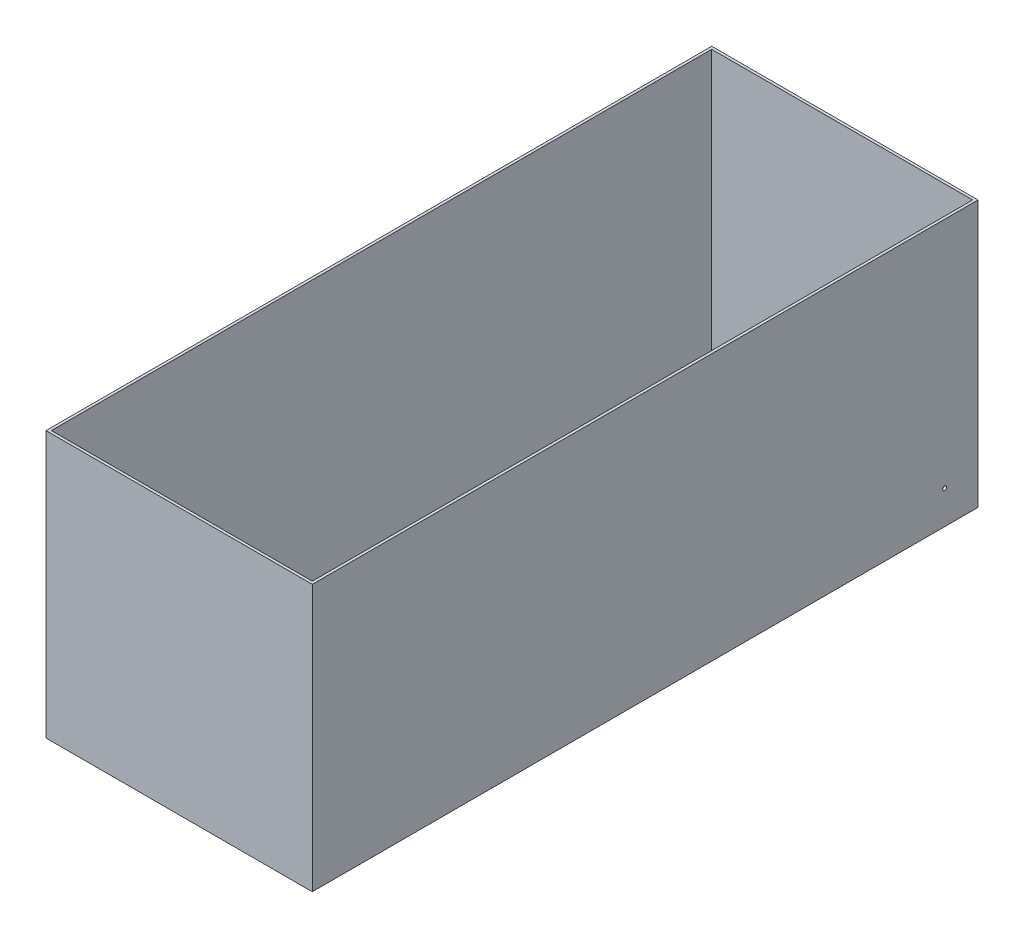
ISO-10303-21;
HEADER;
FILE_DESCRIPTION(('STEP AP214'),'2;1');
FILE_NAME('part.step','',(''),(''),'','','');
FILE_SCHEMA(('AUTOMOTIVE_DESIGN { 1 0 10303 214 1 1 1 1 }'));
ENDSEC;
DATA;
#1=APPLICATION_CONTEXT('core data for automotive mechanical design processes');
#2=APPLICATION_PROTOCOL_DEFINITION('international standard','automotive_design',2000,#1);
#3=PRODUCT_CONTEXT('',#1,'mechanical');
#4=PRODUCT('Part','Part','',(#3));
#5=PRODUCT_RELATED_PRODUCT_CATEGORY('part','',(#4));
#6=PRODUCT_DEFINITION_FORMATION('','',#4);
#7=PRODUCT_DEFINITION_CONTEXT('part definition',#1,'design');
#8=PRODUCT_DEFINITION('design','',#6,#7);
#9=PRODUCT_DEFINITION_SHAPE('','',#8);
#10=(LENGTH_UNIT() NAMED_UNIT(*) SI_UNIT(.MILLI.,.METRE.));
#11=(NAMED_UNIT(*) PLANE_ANGLE_UNIT() SI_UNIT($,.RADIAN.));
#12=(NAMED_UNIT(*) SI_UNIT($,.STERADIAN.) SOLID_ANGLE_UNIT());
#13=UNCERTAINTY_MEASURE_WITH_UNIT(LENGTH_MEASURE(1.E-05),#10,'distance_accuracy_value','');
#14=(GEOMETRIC_REPRESENTATION_CONTEXT(3) GLOBAL_UNCERTAINTY_ASSIGNED_CONTEXT((#13)) GLOBAL_UNIT_ASSIGNED_CONTEXT((#10,
#11,#12)) REPRESENTATION_CONTEXT('',''));
#15=CARTESIAN_POINT('',(0.,0.,0.));
#16=DIRECTION('',(0.,0.,1.));
#17=DIRECTION('',(1.,0.,0.));
#18=AXIS2_PLACEMENT_3D('',#15,#16,#17);
#19=CARTESIAN_POINT('',(0.,200.,0.));
#20=DIRECTION('',(0.,-1.,0.));
#21=DIRECTION('',(0.,0.,-1.));
#22=AXIS2_PLACEMENT_3D('',#19,#20,#21);
#23=PLANE('',#22);
#24=DIRECTION('',(0.,0.,-1.));
#25=VECTOR('',#24,1.);
#26=CARTESIAN_POINT('',(100.,200.,250.));
#27=LINE('',#26,#25);
#28=CARTESIAN_POINT('',(100.,200.,250.));
#29=VERTEX_POINT('',#28);
#30=CARTESIAN_POINT('',(100.,200.,-250.));
#31=VERTEX_POINT('',#30);
#32=EDGE_CURVE('E159',#29,#31,#27,.T.);
#33=ORIENTED_EDGE('',*,*,#32,.T.);
#34=DIRECTION('',(-1.,0.,0.));
#35=VECTOR('',#34,1.);
#36=CARTESIAN_POINT('',(-100.,200.,-250.));
#37=LINE('',#36,#35);
#38=CARTESIAN_POINT('',(-100.,200.,-250.));
#39=VERTEX_POINT('',#38);
#40=EDGE_CURVE('E94',#31,#39,#37,.T.);
#41=ORIENTED_EDGE('',*,*,#40,.T.);
#42=DIRECTION('',(0.,0.,1.));
#43=VECTOR('',#42,1.);
#44=CARTESIAN_POINT('',(-100.,200.,250.));
#45=LINE('',#44,#43);
#46=CARTESIAN_POINT('',(-100.,200.,250.));
#47=VERTEX_POINT('',#46);
#48=EDGE_CURVE('E164',#39,#47,#45,.T.);
#49=ORIENTED_EDGE('',*,*,#48,.T.);
#50=DIRECTION('',(1.,0.,0.));
#51=VECTOR('',#50,1.);
#52=CARTESIAN_POINT('',(-100.,200.,250.));
#53=LINE('',#52,#51);
#54=EDGE_CURVE('E66',#47,#29,#53,.T.);
#55=ORIENTED_EDGE('',*,*,#54,.T.);
#56=EDGE_LOOP('',(#33,#41,#49,#55));
#57=FACE_BOUND('',#56,.T.);
#58=DIRECTION('',(0.,0.,-1.));
#59=VECTOR('',#58,1.);
#60=CARTESIAN_POINT('',(98.,200.,0.));
#61=LINE('',#60,#59);
#62=CARTESIAN_POINT('',(98.,200.,248.));
#63=VERTEX_POINT('',#62);
#64=CARTESIAN_POINT('',(98.,200.,-248.));
#65=VERTEX_POINT('',#64);
#66=EDGE_CURVE('E143',#63,#65,#61,.T.);
#67=ORIENTED_EDGE('',*,*,#66,.F.);
#68=DIRECTION('',(1.,0.,0.));
#69=VECTOR('',#68,1.);
#70=CARTESIAN_POINT('',(0.,200.,248.));
#71=LINE('',#70,#69);
#72=CARTESIAN_POINT('',(-98.,200.,248.));
#73=VERTEX_POINT('',#72);
#74=EDGE_CURVE('E156',#73,#63,#71,.T.);
#75=ORIENTED_EDGE('',*,*,#74,.F.);
#76=DIRECTION('',(0.,0.,1.));
#77=VECTOR('',#76,1.);
#78=CARTESIAN_POINT('',(-98.,200.,0.));
#79=LINE('',#78,#77);
#80=CARTESIAN_POINT('',(-98.,200.,-248.));
#81=VERTEX_POINT('',#80);
#82=EDGE_CURVE('E153',#81,#73,#79,.T.);
#83=ORIENTED_EDGE('',*,*,#82,.F.);
#84=DIRECTION('',(-1.,0.,0.));
#85=VECTOR('',#84,1.);
#86=CARTESIAN_POINT('',(0.,200.,-248.));
#87=LINE('',#86,#85);
#88=EDGE_CURVE('E132',#65,#81,#87,.T.);
#89=ORIENTED_EDGE('',*,*,#88,.F.);
#90=EDGE_LOOP('',(#67,#75,#83,#89));
#91=FACE_BOUND('',#90,.T.);
#92=ADVANCED_FACE('F39',(#57,#91),#23,.F.);
#93=CARTESIAN_POINT('',(100.,200.,250.));
#94=DIRECTION('',(-1.,0.,0.));
#95=DIRECTION('',(0.,0.,1.));
#96=AXIS2_PLACEMENT_3D('',#93,#94,#95);
#97=PLANE('',#96);
#98=CARTESIAN_POINT('',(100.,25.,-225.));
#99=DIRECTION('',(1.,0.,0.));
#100=DIRECTION('',(0.,0.,-1.));
#101=AXIS2_PLACEMENT_3D('',#98,#99,#100);
#102=CIRCLE('',#101,1.5);
#103=CARTESIAN_POINT('',(100.,25.,-226.5));
#104=VERTEX_POINT('',#103);
#105=EDGE_CURVE('E192',#104,#104,#102,.T.);
#106=ORIENTED_EDGE('',*,*,#105,.F.);
#107=EDGE_LOOP('',(#106));
#108=FACE_BOUND('',#107,.T.);
#109=DIRECTION('',(0.,0.,-1.));
#110=VECTOR('',#109,1.);
#111=CARTESIAN_POINT('',(100.,0.,250.));
#112=LINE('',#111,#110);
#113=CARTESIAN_POINT('',(100.,0.,250.));
#114=VERTEX_POINT('',#113);
#115=CARTESIAN_POINT('',(100.,0.,-250.));
#116=VERTEX_POINT('',#115);
#117=EDGE_CURVE('E170',#114,#116,#112,.T.);
#118=ORIENTED_EDGE('',*,*,#117,.T.);
#119=DIRECTION('',(0.,-1.,0.));
#120=VECTOR('',#119,1.);
#121=CARTESIAN_POINT('',(100.,200.,-250.));
#122=LINE('',#121,#120);
#123=EDGE_CURVE('E11',#31,#116,#122,.T.);
#124=ORIENTED_EDGE('',*,*,#123,.F.);
#125=ORIENTED_EDGE('',*,*,#32,.F.);
#126=DIRECTION('',(0.,-1.,0.));
#127=VECTOR('',#126,1.);
#128=CARTESIAN_POINT('',(100.,200.,250.));
#129=LINE('',#128,#127);
#130=EDGE_CURVE('E169',#29,#114,#129,.T.);
#131=ORIENTED_EDGE('',*,*,#130,.T.);
#132=EDGE_LOOP('',(#118,#124,#125,#131));
#133=FACE_BOUND('',#132,.T.);
#134=ADVANCED_FACE('F41',(#108,#133),#97,.F.);
#135=CARTESIAN_POINT('',(-100.,200.,-250.));
#136=DIRECTION('',(0.,0.,1.));
#137=DIRECTION('',(1.,0.,0.));
#138=AXIS2_PLACEMENT_3D('',#135,#136,#137);
#139=PLANE('',#138);
#140=DIRECTION('',(-1.,0.,0.));
#141=VECTOR('',#140,1.);
#142=CARTESIAN_POINT('',(-100.,0.,-250.));
#143=LINE('',#142,#141);
#144=CARTESIAN_POINT('',(-100.,0.,-250.));
#145=VERTEX_POINT('',#144);
#146=EDGE_CURVE('E174',#116,#145,#143,.T.);
#147=ORIENTED_EDGE('',*,*,#146,.T.);
#148=DIRECTION('',(0.,-1.,0.));
#149=VECTOR('',#148,1.);
#150=CARTESIAN_POINT('',(-100.,200.,-250.));
#151=LINE('',#150,#149);
#152=EDGE_CURVE('E49',#39,#145,#151,.T.);
#153=ORIENTED_EDGE('',*,*,#152,.F.);
#154=ORIENTED_EDGE('',*,*,#40,.F.);
#155=ORIENTED_EDGE('',*,*,#123,.T.);
#156=EDGE_LOOP('',(#147,#153,#154,#155));
#157=FACE_BOUND('',#156,.T.);
#158=ADVANCED_FACE('F223',(#157),#139,.F.);
#159=CARTESIAN_POINT('',(-100.,200.,250.));
#160=DIRECTION('',(1.,0.,0.));
#161=DIRECTION('',(0.,0.,-1.));
#162=AXIS2_PLACEMENT_3D('',#159,#160,#161);
#163=PLANE('',#162);
#164=CARTESIAN_POINT('',(-100.,175.,225.));
#165=DIRECTION('',(-1.,0.,0.));
#166=DIRECTION('',(0.,0.,1.));
#167=AXIS2_PLACEMENT_3D('',#164,#165,#166);
#168=CIRCLE('',#167,1.5);
#169=CARTESIAN_POINT('',(-100.,175.,226.5));
#170=VERTEX_POINT('',#169);
#171=EDGE_CURVE('E204',#170,#170,#168,.T.);
#172=ORIENTED_EDGE('',*,*,#171,.F.);
#173=EDGE_LOOP('',(#172));
#174=FACE_BOUND('',#173,.T.);
#175=DIRECTION('',(0.,0.,1.));
#176=VECTOR('',#175,1.);
#177=CARTESIAN_POINT('',(-100.,0.,250.));
#178=LINE('',#177,#176);
#179=CARTESIAN_POINT('',(-100.,0.,250.));
#180=VERTEX_POINT('',#179);
#181=EDGE_CURVE('E177',#145,#180,#178,.T.);
#182=ORIENTED_EDGE('',*,*,#181,.T.);
#183=DIRECTION('',(0.,-1.,0.));
#184=VECTOR('',#183,1.);
#185=CARTESIAN_POINT('',(-100.,200.,250.));
#186=LINE('',#185,#184);
#187=EDGE_CURVE('E184',#47,#180,#186,.T.);
#188=ORIENTED_EDGE('',*,*,#187,.F.);
#189=ORIENTED_EDGE('',*,*,#48,.F.);
#190=ORIENTED_EDGE('',*,*,#152,.T.);
#191=EDGE_LOOP('',(#182,#188,#189,#190));
#192=FACE_BOUND('',#191,.T.);
#193=ADVANCED_FACE('F235',(#174,#192),#163,.F.);
#194=CARTESIAN_POINT('',(-100.,200.,250.));
#195=DIRECTION('',(0.,0.,-1.));
#196=DIRECTION('',(-1.,0.,0.));
#197=AXIS2_PLACEMENT_3D('',#194,#195,#196);
#198=PLANE('',#197);
#199=DIRECTION('',(1.,0.,0.));
#200=VECTOR('',#199,1.);
#201=CARTESIAN_POINT('',(-100.,0.,250.));
#202=LINE('',#201,#200);
#203=EDGE_CURVE('E87',#180,#114,#202,.T.);
#204=ORIENTED_EDGE('',*,*,#203,.T.);
#205=ORIENTED_EDGE('',*,*,#130,.F.);
#206=ORIENTED_EDGE('',*,*,#54,.F.);
#207=ORIENTED_EDGE('',*,*,#187,.T.);
#208=EDGE_LOOP('',(#204,#205,#206,#207));
#209=FACE_BOUND('',#208,.T.);
#210=ADVANCED_FACE('F231',(#209),#198,.F.);
#211=CARTESIAN_POINT('',(0.,0.,0.));
#212=DIRECTION('',(0.,-1.,0.));
#213=DIRECTION('',(0.,0.,-1.));
#214=AXIS2_PLACEMENT_3D('',#211,#212,#213);
#215=PLANE('',#214);
#216=ORIENTED_EDGE('',*,*,#117,.F.);
#217=ORIENTED_EDGE('',*,*,#203,.F.);
#218=ORIENTED_EDGE('',*,*,#181,.F.);
#219=ORIENTED_EDGE('',*,*,#146,.F.);
#220=EDGE_LOOP('',(#216,#217,#218,#219));
#221=FACE_BOUND('',#220,.T.);
#222=ADVANCED_FACE('F228',(#221),#215,.T.);
#223=CARTESIAN_POINT('',(98.,200.,250.));
#224=DIRECTION('',(-1.,0.,0.));
#225=DIRECTION('',(0.,0.,1.));
#226=AXIS2_PLACEMENT_3D('',#223,#224,#225);
#227=PLANE('',#226);
#228=CARTESIAN_POINT('',(98.,25.,-225.));
#229=DIRECTION('',(-1.,0.,0.));
#230=DIRECTION('',(0.,0.,1.));
#231=AXIS2_PLACEMENT_3D('',#228,#229,#230);
#232=CIRCLE('',#231,1.5);
#233=CARTESIAN_POINT('',(98.,25.,-223.5));
#234=VERTEX_POINT('',#233);
#235=EDGE_CURVE('E189',#234,#234,#232,.T.);
#236=ORIENTED_EDGE('',*,*,#235,.F.);
#237=EDGE_LOOP('',(#236));
#238=FACE_BOUND('',#237,.T.);
#239=DIRECTION('',(0.,0.,-1.));
#240=VECTOR('',#239,1.);
#241=CARTESIAN_POINT('',(98.,2.,0.));
#242=LINE('',#241,#240);
#243=CARTESIAN_POINT('',(98.,2.,248.));
#244=VERTEX_POINT('',#243);
#245=CARTESIAN_POINT('',(98.,2.,-248.));
#246=VERTEX_POINT('',#245);
#247=EDGE_CURVE('E122',#244,#246,#242,.T.);
#248=ORIENTED_EDGE('',*,*,#247,.F.);
#249=DIRECTION('',(0.,-1.,0.));
#250=VECTOR('',#249,1.);
#251=CARTESIAN_POINT('',(98.,200.,248.));
#252=LINE('',#251,#250);
#253=EDGE_CURVE('E147',#63,#244,#252,.T.);
#254=ORIENTED_EDGE('',*,*,#253,.F.);
#255=ORIENTED_EDGE('',*,*,#66,.T.);
#256=DIRECTION('',(0.,-1.,0.));
#257=VECTOR('',#256,1.);
#258=CARTESIAN_POINT('',(98.,200.,-248.));
#259=LINE('',#258,#257);
#260=EDGE_CURVE('E136',#65,#246,#259,.T.);
#261=ORIENTED_EDGE('',*,*,#260,.T.);
#262=EDGE_LOOP('',(#248,#254,#255,#261));
#263=FACE_BOUND('',#262,.T.);
#264=ADVANCED_FACE('F216',(#238,#263),#227,.T.);
#265=CARTESIAN_POINT('',(-100.,200.,-248.));
#266=DIRECTION('',(0.,0.,1.));
#267=DIRECTION('',(1.,0.,0.));
#268=AXIS2_PLACEMENT_3D('',#265,#266,#267);
#269=PLANE('',#268);
#270=DIRECTION('',(-1.,0.,0.));
#271=VECTOR('',#270,1.);
#272=CARTESIAN_POINT('',(0.,2.,-248.));
#273=LINE('',#272,#271);
#274=CARTESIAN_POINT('',(-98.,2.,-248.));
#275=VERTEX_POINT('',#274);
#276=EDGE_CURVE('E116',#246,#275,#273,.T.);
#277=ORIENTED_EDGE('',*,*,#276,.F.);
#278=ORIENTED_EDGE('',*,*,#260,.F.);
#279=ORIENTED_EDGE('',*,*,#88,.T.);
#280=DIRECTION('',(0.,-1.,0.));
#281=VECTOR('',#280,1.);
#282=CARTESIAN_POINT('',(-98.,200.,-248.));
#283=LINE('',#282,#281);
#284=EDGE_CURVE('E129',#81,#275,#283,.T.);
#285=ORIENTED_EDGE('',*,*,#284,.T.);
#286=EDGE_LOOP('',(#277,#278,#279,#285));
#287=FACE_BOUND('',#286,.T.);
#288=ADVANCED_FACE('F130',(#287),#269,.T.);
#289=CARTESIAN_POINT('',(-98.,200.,250.));
#290=DIRECTION('',(1.,0.,0.));
#291=DIRECTION('',(0.,0.,-1.));
#292=AXIS2_PLACEMENT_3D('',#289,#290,#291);
#293=PLANE('',#292);
#294=CARTESIAN_POINT('',(-98.,175.,225.));
#295=DIRECTION('',(1.,0.,0.));
#296=DIRECTION('',(0.,0.,-1.));
#297=AXIS2_PLACEMENT_3D('',#294,#295,#296);
#298=CIRCLE('',#297,1.5);
#299=CARTESIAN_POINT('',(-98.,175.,223.5));
#300=VERTEX_POINT('',#299);
#301=EDGE_CURVE('E43',#300,#300,#298,.T.);
#302=ORIENTED_EDGE('',*,*,#301,.F.);
#303=EDGE_LOOP('',(#302));
#304=FACE_BOUND('',#303,.T.);
#305=DIRECTION('',(0.,0.,1.));
#306=VECTOR('',#305,1.);
#307=CARTESIAN_POINT('',(-98.,2.,0.));
#308=LINE('',#307,#306);
#309=CARTESIAN_POINT('',(-98.,2.,248.));
#310=VERTEX_POINT('',#309);
#311=EDGE_CURVE('E120',#275,#310,#308,.T.);
#312=ORIENTED_EDGE('',*,*,#311,.F.);
#313=ORIENTED_EDGE('',*,*,#284,.F.);
#314=ORIENTED_EDGE('',*,*,#82,.T.);
#315=DIRECTION('',(0.,-1.,0.));
#316=VECTOR('',#315,1.);
#317=CARTESIAN_POINT('',(-98.,200.,248.));
#318=LINE('',#317,#316);
#319=EDGE_CURVE('E57',#73,#310,#318,.T.);
#320=ORIENTED_EDGE('',*,*,#319,.T.);
#321=EDGE_LOOP('',(#312,#313,#314,#320));
#322=FACE_BOUND('',#321,.T.);
#323=ADVANCED_FACE('F138',(#304,#322),#293,.T.);
#324=CARTESIAN_POINT('',(-100.,200.,248.));
#325=DIRECTION('',(0.,0.,-1.));
#326=DIRECTION('',(-1.,0.,0.));
#327=AXIS2_PLACEMENT_3D('',#324,#325,#326);
#328=PLANE('',#327);
#329=DIRECTION('',(1.,0.,0.));
#330=VECTOR('',#329,1.);
#331=CARTESIAN_POINT('',(0.,2.,248.));
#332=LINE('',#331,#330);
#333=EDGE_CURVE('E140',#310,#244,#332,.T.);
#334=ORIENTED_EDGE('',*,*,#333,.F.);
#335=ORIENTED_EDGE('',*,*,#319,.F.);
#336=ORIENTED_EDGE('',*,*,#74,.T.);
#337=ORIENTED_EDGE('',*,*,#253,.T.);
#338=EDGE_LOOP('',(#334,#335,#336,#337));
#339=FACE_BOUND('',#338,.T.);
#340=ADVANCED_FACE('F212',(#339),#328,.T.);
#341=CARTESIAN_POINT('',(0.,2.,0.));
#342=DIRECTION('',(0.,-1.,0.));
#343=DIRECTION('',(0.,0.,-1.));
#344=AXIS2_PLACEMENT_3D('',#341,#342,#343);
#345=PLANE('',#344);
#346=ORIENTED_EDGE('',*,*,#247,.T.);
#347=ORIENTED_EDGE('',*,*,#276,.T.);
#348=ORIENTED_EDGE('',*,*,#311,.T.);
#349=ORIENTED_EDGE('',*,*,#333,.T.);
#350=EDGE_LOOP('',(#346,#347,#348,#349));
#351=FACE_BOUND('',#350,.T.);
#352=ADVANCED_FACE('F118',(#351),#345,.F.);
#353=CARTESIAN_POINT('',(57.0000000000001,25.,-225.));
#354=DIRECTION('',(1.,0.,0.));
#355=DIRECTION('',(0.,0.,-1.));
#356=AXIS2_PLACEMENT_3D('',#353,#354,#355);
#357=CYLINDRICAL_SURFACE('',#356,1.5);
#358=ORIENTED_EDGE('',*,*,#235,.T.);
#359=EDGE_LOOP('',(#358));
#360=FACE_BOUND('',#359,.T.);
#361=ORIENTED_EDGE('',*,*,#105,.T.);
#362=EDGE_LOOP('',(#361));
#363=FACE_BOUND('',#362,.T.);
#364=ADVANCED_FACE('F296',(#360,#363),#357,.F.);
#365=CARTESIAN_POINT('',(-57.0000000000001,175.,225.));
#366=DIRECTION('',(-1.,0.,0.));
#367=DIRECTION('',(0.,0.,1.));
#368=AXIS2_PLACEMENT_3D('',#365,#366,#367);
#369=CYLINDRICAL_SURFACE('',#368,1.5);
#370=ORIENTED_EDGE('',*,*,#301,.T.);
#371=EDGE_LOOP('',(#370));
#372=FACE_BOUND('',#371,.T.);
#373=ORIENTED_EDGE('',*,*,#171,.T.);
#374=EDGE_LOOP('',(#373));
#375=FACE_BOUND('',#374,.T.);
#376=ADVANCED_FACE('F301',(#372,#375),#369,.F.);
#377=CLOSED_SHELL('',(#92,#134,#158,#193,#210,#222,#264,#288,#323,#340,#352,#364,#376));
#378=MANIFOLD_SOLID_BREP('B2',#377);
#379=ADVANCED_BREP_SHAPE_REPRESENTATION('',(#18,#378),#14);
#380=SHAPE_DEFINITION_REPRESENTATION(#9,#379);
ENDSEC;
END-ISO-10303-21;
